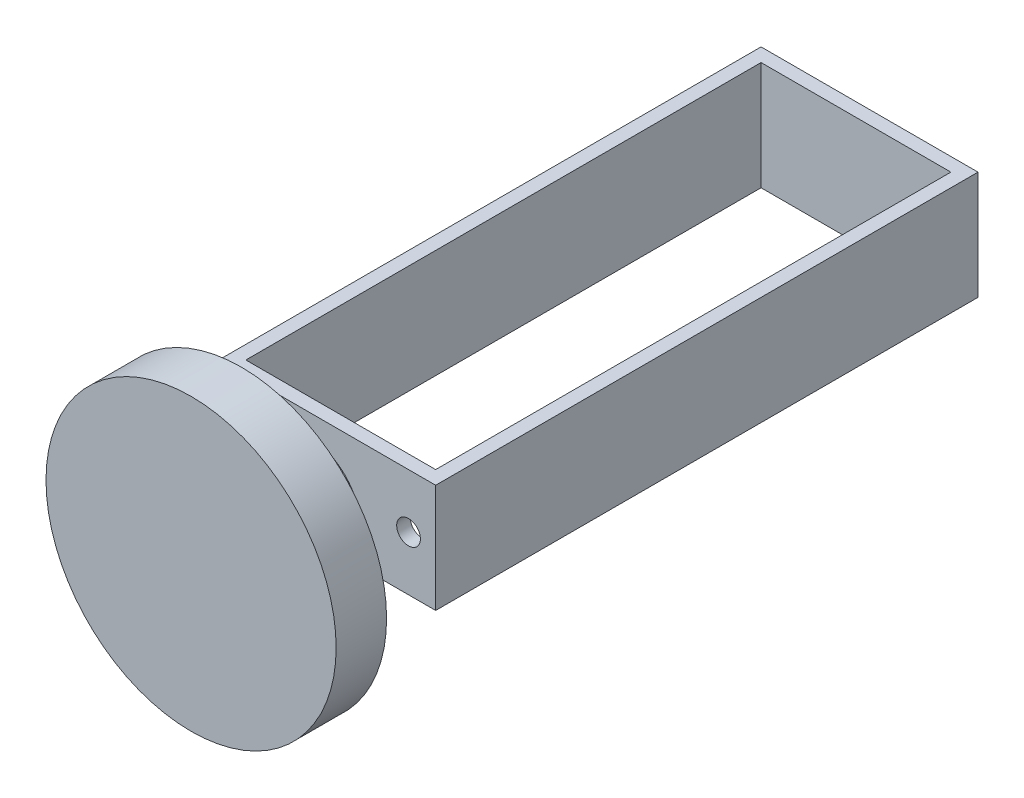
ISO-10303-21;
HEADER;
FILE_DESCRIPTION(('STEP AP214'),'2;1');
FILE_NAME('part.step','',(''),(''),'','','');
FILE_SCHEMA(('AUTOMOTIVE_DESIGN { 1 0 10303 214 1 1 1 1 }'));
ENDSEC;
DATA;
#1=APPLICATION_CONTEXT('core data for automotive mechanical design processes');
#2=APPLICATION_PROTOCOL_DEFINITION('international standard','automotive_design',2000,#1);
#3=PRODUCT_CONTEXT('',#1,'mechanical');
#4=PRODUCT('Part','Part','',(#3));
#5=PRODUCT_RELATED_PRODUCT_CATEGORY('part','',(#4));
#6=PRODUCT_DEFINITION_FORMATION('','',#4);
#7=PRODUCT_DEFINITION_CONTEXT('part definition',#1,'design');
#8=PRODUCT_DEFINITION('design','',#6,#7);
#9=PRODUCT_DEFINITION_SHAPE('','',#8);
#10=(LENGTH_UNIT() NAMED_UNIT(*) SI_UNIT(.MILLI.,.METRE.));
#11=(NAMED_UNIT(*) PLANE_ANGLE_UNIT() SI_UNIT($,.RADIAN.));
#12=(NAMED_UNIT(*) SI_UNIT($,.STERADIAN.) SOLID_ANGLE_UNIT());
#13=UNCERTAINTY_MEASURE_WITH_UNIT(LENGTH_MEASURE(1.E-05),#10,'distance_accuracy_value','');
#14=(GEOMETRIC_REPRESENTATION_CONTEXT(3) GLOBAL_UNCERTAINTY_ASSIGNED_CONTEXT((#13)) GLOBAL_UNIT_ASSIGNED_CONTEXT((#10,
#11,#12)) REPRESENTATION_CONTEXT('',''));
#15=CARTESIAN_POINT('',(0.,0.,0.));
#16=DIRECTION('',(0.,0.,1.));
#17=DIRECTION('',(1.,0.,0.));
#18=AXIS2_PLACEMENT_3D('',#15,#16,#17);
#19=CARTESIAN_POINT('',(0.,25.4,0.));
#20=DIRECTION('',(0.,-1.,0.));
#21=DIRECTION('',(0.,0.,-1.));
#22=AXIS2_PLACEMENT_3D('',#19,#20,#21);
#23=PLANE('',#22);
#24=DIRECTION('',(0.,0.,-1.));
#25=VECTOR('',#24,1.);
#26=CARTESIAN_POINT('',(25.4,25.4,63.5));
#27=LINE('',#26,#25);
#28=CARTESIAN_POINT('',(25.4,25.4,63.5));
#29=VERTEX_POINT('',#28);
#30=CARTESIAN_POINT('',(25.4,25.4,-63.5));
#31=VERTEX_POINT('',#30);
#32=EDGE_CURVE('E143',#29,#31,#27,.T.);
#33=ORIENTED_EDGE('',*,*,#32,.T.);
#34=DIRECTION('',(-1.,0.,0.));
#35=VECTOR('',#34,1.);
#36=CARTESIAN_POINT('',(-25.4,25.4,-63.5));
#37=LINE('',#36,#35);
#38=CARTESIAN_POINT('',(-25.4,25.4,-63.5));
#39=VERTEX_POINT('',#38);
#40=EDGE_CURVE('E146',#31,#39,#37,.T.);
#41=ORIENTED_EDGE('',*,*,#40,.T.);
#42=DIRECTION('',(0.,0.,1.));
#43=VECTOR('',#42,1.);
#44=CARTESIAN_POINT('',(-25.4,25.4,63.5));
#45=LINE('',#44,#43);
#46=CARTESIAN_POINT('',(-25.4,25.4,63.5));
#47=VERTEX_POINT('',#46);
#48=EDGE_CURVE('E149',#39,#47,#45,.T.);
#49=ORIENTED_EDGE('',*,*,#48,.T.);
#50=DIRECTION('',(1.,0.,0.));
#51=VECTOR('',#50,1.);
#52=CARTESIAN_POINT('',(-25.4,25.4,63.5));
#53=LINE('',#52,#51);
#54=EDGE_CURVE('E151',#47,#29,#53,.T.);
#55=ORIENTED_EDGE('',*,*,#54,.T.);
#56=EDGE_LOOP('',(#33,#41,#49,#55));
#57=FACE_BOUND('',#56,.T.);
#58=DIRECTION('',(0.,0.,1.));
#59=VECTOR('',#58,1.);
#60=CARTESIAN_POINT('',(-22.225,25.4,60.325));
#61=LINE('',#60,#59);
#62=CARTESIAN_POINT('',(-22.225,25.4,-60.325));
#63=VERTEX_POINT('',#62);
#64=CARTESIAN_POINT('',(-22.225,25.4,60.325));
#65=VERTEX_POINT('',#64);
#66=EDGE_CURVE('E105',#63,#65,#61,.T.);
#67=ORIENTED_EDGE('',*,*,#66,.F.);
#68=DIRECTION('',(-1.,0.,0.));
#69=VECTOR('',#68,1.);
#70=CARTESIAN_POINT('',(-22.225,25.4,-60.325));
#71=LINE('',#70,#69);
#72=CARTESIAN_POINT('',(22.225,25.4,-60.325));
#73=VERTEX_POINT('',#72);
#74=EDGE_CURVE('E127',#73,#63,#71,.T.);
#75=ORIENTED_EDGE('',*,*,#74,.F.);
#76=DIRECTION('',(0.,0.,-1.));
#77=VECTOR('',#76,1.);
#78=CARTESIAN_POINT('',(22.225,25.4,60.325));
#79=LINE('',#78,#77);
#80=CARTESIAN_POINT('',(22.225,25.4,60.325));
#81=VERTEX_POINT('',#80);
#82=EDGE_CURVE('E125',#81,#73,#79,.T.);
#83=ORIENTED_EDGE('',*,*,#82,.F.);
#84=DIRECTION('',(1.,0.,0.));
#85=VECTOR('',#84,1.);
#86=CARTESIAN_POINT('',(-22.225,25.4,60.325));
#87=LINE('',#86,#85);
#88=EDGE_CURVE('E113',#65,#81,#87,.T.);
#89=ORIENTED_EDGE('',*,*,#88,.F.);
#90=EDGE_LOOP('',(#67,#75,#83,#89));
#91=FACE_BOUND('',#90,.T.);
#92=ADVANCED_FACE('F40',(#57,#91),#23,.F.);
#93=CARTESIAN_POINT('',(0.,0.,0.));
#94=DIRECTION('',(0.,-1.,0.));
#95=DIRECTION('',(0.,0.,-1.));
#96=AXIS2_PLACEMENT_3D('',#93,#94,#95);
#97=PLANE('',#96);
#98=DIRECTION('',(0.,0.,-1.));
#99=VECTOR('',#98,1.);
#100=CARTESIAN_POINT('',(25.4,0.,63.5));
#101=LINE('',#100,#99);
#102=CARTESIAN_POINT('',(25.4,0.,63.5));
#103=VERTEX_POINT('',#102);
#104=CARTESIAN_POINT('',(25.4,0.,-63.5));
#105=VERTEX_POINT('',#104);
#106=EDGE_CURVE('E121',#103,#105,#101,.T.);
#107=ORIENTED_EDGE('',*,*,#106,.F.);
#108=DIRECTION('',(1.,0.,0.));
#109=VECTOR('',#108,1.);
#110=CARTESIAN_POINT('',(-25.4,0.,63.5));
#111=LINE('',#110,#109);
#112=CARTESIAN_POINT('',(-25.4,0.,63.5));
#113=VERTEX_POINT('',#112);
#114=EDGE_CURVE('E147',#113,#103,#111,.T.);
#115=ORIENTED_EDGE('',*,*,#114,.F.);
#116=DIRECTION('',(0.,0.,1.));
#117=VECTOR('',#116,1.);
#118=CARTESIAN_POINT('',(-25.4,0.,63.5));
#119=LINE('',#118,#117);
#120=CARTESIAN_POINT('',(-25.4,0.,-63.5));
#121=VERTEX_POINT('',#120);
#122=EDGE_CURVE('E158',#121,#113,#119,.T.);
#123=ORIENTED_EDGE('',*,*,#122,.F.);
#124=DIRECTION('',(-1.,0.,0.));
#125=VECTOR('',#124,1.);
#126=CARTESIAN_POINT('',(-25.4,0.,-63.5));
#127=LINE('',#126,#125);
#128=EDGE_CURVE('E156',#105,#121,#127,.T.);
#129=ORIENTED_EDGE('',*,*,#128,.F.);
#130=EDGE_LOOP('',(#107,#115,#123,#129));
#131=FACE_BOUND('',#130,.T.);
#132=DIRECTION('',(-1.,0.,0.));
#133=VECTOR('',#132,1.);
#134=CARTESIAN_POINT('',(-22.225,0.,-60.325));
#135=LINE('',#134,#133);
#136=CARTESIAN_POINT('',(22.225,0.,-60.325));
#137=VERTEX_POINT('',#136);
#138=CARTESIAN_POINT('',(-22.225,0.,-60.325));
#139=VERTEX_POINT('',#138);
#140=EDGE_CURVE('E114',#137,#139,#135,.T.);
#141=ORIENTED_EDGE('',*,*,#140,.T.);
#142=DIRECTION('',(0.,0.,1.));
#143=VECTOR('',#142,1.);
#144=CARTESIAN_POINT('',(-22.225,0.,60.325));
#145=LINE('',#144,#143);
#146=CARTESIAN_POINT('',(-22.225,0.,60.325));
#147=VERTEX_POINT('',#146);
#148=EDGE_CURVE('E63',#139,#147,#145,.T.);
#149=ORIENTED_EDGE('',*,*,#148,.T.);
#150=DIRECTION('',(1.,0.,0.));
#151=VECTOR('',#150,1.);
#152=CARTESIAN_POINT('',(-22.225,0.,60.325));
#153=LINE('',#152,#151);
#154=CARTESIAN_POINT('',(22.225,0.,60.325));
#155=VERTEX_POINT('',#154);
#156=EDGE_CURVE('E120',#147,#155,#153,.T.);
#157=ORIENTED_EDGE('',*,*,#156,.T.);
#158=DIRECTION('',(0.,0.,-1.));
#159=VECTOR('',#158,1.);
#160=CARTESIAN_POINT('',(22.225,0.,60.325));
#161=LINE('',#160,#159);
#162=EDGE_CURVE('E135',#155,#137,#161,.T.);
#163=ORIENTED_EDGE('',*,*,#162,.T.);
#164=EDGE_LOOP('',(#141,#149,#157,#163));
#165=FACE_BOUND('',#164,.T.);
#166=ADVANCED_FACE('F232',(#131,#165),#97,.T.);
#167=CARTESIAN_POINT('',(25.4,25.4,63.5));
#168=DIRECTION('',(-1.,0.,0.));
#169=DIRECTION('',(0.,0.,1.));
#170=AXIS2_PLACEMENT_3D('',#167,#168,#169);
#171=PLANE('',#170);
#172=ORIENTED_EDGE('',*,*,#106,.T.);
#173=DIRECTION('',(0.,-1.,0.));
#174=VECTOR('',#173,1.);
#175=CARTESIAN_POINT('',(25.4,25.4,-63.5));
#176=LINE('',#175,#174);
#177=EDGE_CURVE('E48',#31,#105,#176,.T.);
#178=ORIENTED_EDGE('',*,*,#177,.F.);
#179=ORIENTED_EDGE('',*,*,#32,.F.);
#180=DIRECTION('',(0.,-1.,0.));
#181=VECTOR('',#180,1.);
#182=CARTESIAN_POINT('',(25.4,25.4,63.5));
#183=LINE('',#182,#181);
#184=EDGE_CURVE('E153',#29,#103,#183,.T.);
#185=ORIENTED_EDGE('',*,*,#184,.T.);
#186=EDGE_LOOP('',(#172,#178,#179,#185));
#187=FACE_BOUND('',#186,.T.);
#188=ADVANCED_FACE('F42',(#187),#171,.F.);
#189=CARTESIAN_POINT('',(-25.4,25.4,-63.5));
#190=DIRECTION('',(0.,0.,1.));
#191=DIRECTION('',(1.,0.,0.));
#192=AXIS2_PLACEMENT_3D('',#189,#190,#191);
#193=PLANE('',#192);
#194=ORIENTED_EDGE('',*,*,#128,.T.);
#195=DIRECTION('',(0.,-1.,0.));
#196=VECTOR('',#195,1.);
#197=CARTESIAN_POINT('',(-25.4,25.4,-63.5));
#198=LINE('',#197,#196);
#199=EDGE_CURVE('E166',#39,#121,#198,.T.);
#200=ORIENTED_EDGE('',*,*,#199,.F.);
#201=ORIENTED_EDGE('',*,*,#40,.F.);
#202=ORIENTED_EDGE('',*,*,#177,.T.);
#203=EDGE_LOOP('',(#194,#200,#201,#202));
#204=FACE_BOUND('',#203,.T.);
#205=ADVANCED_FACE('F248',(#204),#193,.F.);
#206=CARTESIAN_POINT('',(-25.4,25.4,63.5));
#207=DIRECTION('',(1.,0.,0.));
#208=DIRECTION('',(0.,0.,-1.));
#209=AXIS2_PLACEMENT_3D('',#206,#207,#208);
#210=PLANE('',#209);
#211=ORIENTED_EDGE('',*,*,#122,.T.);
#212=DIRECTION('',(0.,-1.,0.));
#213=VECTOR('',#212,1.);
#214=CARTESIAN_POINT('',(-25.4,25.4,63.5));
#215=LINE('',#214,#213);
#216=EDGE_CURVE('E163',#47,#113,#215,.T.);
#217=ORIENTED_EDGE('',*,*,#216,.F.);
#218=ORIENTED_EDGE('',*,*,#48,.F.);
#219=ORIENTED_EDGE('',*,*,#199,.T.);
#220=EDGE_LOOP('',(#211,#217,#218,#219));
#221=FACE_BOUND('',#220,.T.);
#222=ADVANCED_FACE('F245',(#221),#210,.F.);
#223=CARTESIAN_POINT('',(-25.4,25.4,63.5));
#224=DIRECTION('',(0.,0.,-1.));
#225=DIRECTION('',(-1.,0.,0.));
#226=AXIS2_PLACEMENT_3D('',#223,#224,#225);
#227=PLANE('',#226);
#228=CARTESIAN_POINT('',(0.,12.7,63.5));
#229=DIRECTION('',(0.,0.,-1.));
#230=DIRECTION('',(-1.,0.,0.));
#231=AXIS2_PLACEMENT_3D('',#228,#229,#230);
#232=CIRCLE('',#231,5.588);
#233=CARTESIAN_POINT('',(-5.588,12.7,63.5));
#234=VERTEX_POINT('',#233);
#235=EDGE_CURVE('E11',#234,#234,#232,.F.);
#236=ORIENTED_EDGE('',*,*,#235,.F.);
#237=EDGE_LOOP('',(#236));
#238=FACE_BOUND('',#237,.T.);
#239=CARTESIAN_POINT('',(-19.05,12.7,63.5));
#240=DIRECTION('',(0.,0.,1.));
#241=DIRECTION('',(1.,0.,0.));
#242=AXIS2_PLACEMENT_3D('',#239,#240,#241);
#243=CIRCLE('',#242,2.778125);
#244=CARTESIAN_POINT('',(-16.271875,12.7,63.5));
#245=VERTEX_POINT('',#244);
#246=EDGE_CURVE('E173',#245,#245,#243,.T.);
#247=ORIENTED_EDGE('',*,*,#246,.F.);
#248=EDGE_LOOP('',(#247));
#249=FACE_BOUND('',#248,.T.);
#250=CARTESIAN_POINT('',(19.05,12.7,63.5));
#251=DIRECTION('',(0.,0.,1.));
#252=DIRECTION('',(1.,0.,0.));
#253=AXIS2_PLACEMENT_3D('',#250,#251,#252);
#254=CIRCLE('',#253,2.778125);
#255=CARTESIAN_POINT('',(21.828125,12.7,63.5));
#256=VERTEX_POINT('',#255);
#257=EDGE_CURVE('E193',#256,#256,#254,.T.);
#258=ORIENTED_EDGE('',*,*,#257,.F.);
#259=EDGE_LOOP('',(#258));
#260=FACE_BOUND('',#259,.T.);
#261=ORIENTED_EDGE('',*,*,#114,.T.);
#262=ORIENTED_EDGE('',*,*,#184,.F.);
#263=ORIENTED_EDGE('',*,*,#54,.F.);
#264=ORIENTED_EDGE('',*,*,#216,.T.);
#265=EDGE_LOOP('',(#261,#262,#263,#264));
#266=FACE_BOUND('',#265,.T.);
#267=ADVANCED_FACE('F242',(#238,#249,#260,#266),#227,.F.);
#268=CARTESIAN_POINT('',(-22.225,25.4,60.325));
#269=DIRECTION('',(1.,0.,0.));
#270=DIRECTION('',(0.,0.,-1.));
#271=AXIS2_PLACEMENT_3D('',#268,#269,#270);
#272=PLANE('',#271);
#273=ORIENTED_EDGE('',*,*,#148,.F.);
#274=DIRECTION('',(0.,-1.,0.));
#275=VECTOR('',#274,1.);
#276=CARTESIAN_POINT('',(-22.225,25.4,-60.325));
#277=LINE('',#276,#275);
#278=EDGE_CURVE('E109',#63,#139,#277,.T.);
#279=ORIENTED_EDGE('',*,*,#278,.F.);
#280=ORIENTED_EDGE('',*,*,#66,.T.);
#281=DIRECTION('',(0.,-1.,0.));
#282=VECTOR('',#281,1.);
#283=CARTESIAN_POINT('',(-22.225,25.4,60.325));
#284=LINE('',#283,#282);
#285=EDGE_CURVE('E108',#65,#147,#284,.T.);
#286=ORIENTED_EDGE('',*,*,#285,.T.);
#287=EDGE_LOOP('',(#273,#279,#280,#286));
#288=FACE_BOUND('',#287,.T.);
#289=ADVANCED_FACE('F107',(#288),#272,.T.);
#290=CARTESIAN_POINT('',(-22.225,25.4,60.325));
#291=DIRECTION('',(0.,0.,-1.));
#292=DIRECTION('',(-1.,0.,0.));
#293=AXIS2_PLACEMENT_3D('',#290,#291,#292);
#294=PLANE('',#293);
#295=CARTESIAN_POINT('',(-19.05,12.7,60.325));
#296=DIRECTION('',(0.,0.,-1.));
#297=DIRECTION('',(-1.,0.,0.));
#298=AXIS2_PLACEMENT_3D('',#295,#296,#297);
#299=CIRCLE('',#298,2.778125);
#300=CARTESIAN_POINT('',(-21.828125,12.7,60.325));
#301=VERTEX_POINT('',#300);
#302=EDGE_CURVE('E133',#301,#301,#299,.T.);
#303=ORIENTED_EDGE('',*,*,#302,.F.);
#304=EDGE_LOOP('',(#303));
#305=FACE_BOUND('',#304,.T.);
#306=CARTESIAN_POINT('',(19.05,12.7,60.325));
#307=DIRECTION('',(0.,0.,-1.));
#308=DIRECTION('',(-1.,0.,0.));
#309=AXIS2_PLACEMENT_3D('',#306,#307,#308);
#310=CIRCLE('',#309,2.778125);
#311=CARTESIAN_POINT('',(16.271875,12.7,60.325));
#312=VERTEX_POINT('',#311);
#313=EDGE_CURVE('E171',#312,#312,#310,.T.);
#314=ORIENTED_EDGE('',*,*,#313,.F.);
#315=EDGE_LOOP('',(#314));
#316=FACE_BOUND('',#315,.T.);
#317=ORIENTED_EDGE('',*,*,#156,.F.);
#318=ORIENTED_EDGE('',*,*,#285,.F.);
#319=ORIENTED_EDGE('',*,*,#88,.T.);
#320=DIRECTION('',(0.,-1.,0.));
#321=VECTOR('',#320,1.);
#322=CARTESIAN_POINT('',(22.225,25.4,60.325));
#323=LINE('',#322,#321);
#324=EDGE_CURVE('E122',#81,#155,#323,.T.);
#325=ORIENTED_EDGE('',*,*,#324,.T.);
#326=EDGE_LOOP('',(#317,#318,#319,#325));
#327=FACE_BOUND('',#326,.T.);
#328=ADVANCED_FACE('F117',(#305,#316,#327),#294,.T.);
#329=CARTESIAN_POINT('',(22.225,25.4,60.325));
#330=DIRECTION('',(-1.,0.,0.));
#331=DIRECTION('',(0.,0.,1.));
#332=AXIS2_PLACEMENT_3D('',#329,#330,#331);
#333=PLANE('',#332);
#334=ORIENTED_EDGE('',*,*,#162,.F.);
#335=ORIENTED_EDGE('',*,*,#324,.F.);
#336=ORIENTED_EDGE('',*,*,#82,.T.);
#337=DIRECTION('',(0.,-1.,0.));
#338=VECTOR('',#337,1.);
#339=CARTESIAN_POINT('',(22.225,25.4,-60.325));
#340=LINE('',#339,#338);
#341=EDGE_CURVE('E55',#73,#137,#340,.T.);
#342=ORIENTED_EDGE('',*,*,#341,.T.);
#343=EDGE_LOOP('',(#334,#335,#336,#342));
#344=FACE_BOUND('',#343,.T.);
#345=ADVANCED_FACE('F182',(#344),#333,.T.);
#346=CARTESIAN_POINT('',(-22.225,25.4,-60.325));
#347=DIRECTION('',(0.,0.,1.));
#348=DIRECTION('',(1.,0.,0.));
#349=AXIS2_PLACEMENT_3D('',#346,#347,#348);
#350=PLANE('',#349);
#351=ORIENTED_EDGE('',*,*,#140,.F.);
#352=ORIENTED_EDGE('',*,*,#341,.F.);
#353=ORIENTED_EDGE('',*,*,#74,.T.);
#354=ORIENTED_EDGE('',*,*,#278,.T.);
#355=EDGE_LOOP('',(#351,#352,#353,#354));
#356=FACE_BOUND('',#355,.T.);
#357=ADVANCED_FACE('F189',(#356),#350,.T.);
#358=CARTESIAN_POINT('',(19.05,12.7,38.1));
#359=DIRECTION('',(0.,0.,1.));
#360=DIRECTION('',(1.,0.,0.));
#361=AXIS2_PLACEMENT_3D('',#358,#359,#360);
#362=CYLINDRICAL_SURFACE('',#361,2.778125);
#363=ORIENTED_EDGE('',*,*,#313,.T.);
#364=EDGE_LOOP('',(#363));
#365=FACE_BOUND('',#364,.T.);
#366=ORIENTED_EDGE('',*,*,#257,.T.);
#367=EDGE_LOOP('',(#366));
#368=FACE_BOUND('',#367,.T.);
#369=ADVANCED_FACE('F186',(#365,#368),#362,.F.);
#370=CARTESIAN_POINT('',(-19.05,12.7,38.1));
#371=DIRECTION('',(0.,0.,1.));
#372=DIRECTION('',(1.,0.,0.));
#373=AXIS2_PLACEMENT_3D('',#370,#371,#372);
#374=CYLINDRICAL_SURFACE('',#373,2.778125);
#375=ORIENTED_EDGE('',*,*,#302,.T.);
#376=EDGE_LOOP('',(#375));
#377=FACE_BOUND('',#376,.T.);
#378=ORIENTED_EDGE('',*,*,#246,.T.);
#379=EDGE_LOOP('',(#378));
#380=FACE_BOUND('',#379,.T.);
#381=ADVANCED_FACE('F177',(#377,#380),#374,.F.);
#382=CARTESIAN_POINT('',(0.,12.7,68.326));
#383=DIRECTION('',(0.,0.,-1.));
#384=DIRECTION('',(-1.,0.,0.));
#385=AXIS2_PLACEMENT_3D('',#382,#383,#384);
#386=CYLINDRICAL_SURFACE('',#385,5.588);
#387=CARTESIAN_POINT('',(0.,12.7,68.326));
#388=DIRECTION('',(0.,0.,1.));
#389=DIRECTION('',(1.,0.,0.));
#390=AXIS2_PLACEMENT_3D('',#387,#388,#389);
#391=CIRCLE('',#390,5.588);
#392=CARTESIAN_POINT('',(5.588,12.7,68.326));
#393=VERTEX_POINT('',#392);
#394=EDGE_CURVE('E195',#393,#393,#391,.T.);
#395=ORIENTED_EDGE('',*,*,#394,.F.);
#396=EDGE_LOOP('',(#395));
#397=FACE_BOUND('',#396,.T.);
#398=ORIENTED_EDGE('',*,*,#235,.T.);
#399=EDGE_LOOP('',(#398));
#400=FACE_BOUND('',#399,.T.);
#401=ADVANCED_FACE('F279',(#397,#400),#386,.T.);
#402=CARTESIAN_POINT('',(0.,12.7,83.566));
#403=DIRECTION('',(0.,0.,-1.));
#404=DIRECTION('',(-1.,0.,0.));
#405=AXIS2_PLACEMENT_3D('',#402,#403,#404);
#406=CYLINDRICAL_SURFACE('',#405,12.7);
#407=CARTESIAN_POINT('',(0.,12.7,83.566));
#408=DIRECTION('',(0.,0.,1.));
#409=DIRECTION('',(1.,0.,0.));
#410=AXIS2_PLACEMENT_3D('',#407,#408,#409);
#411=CIRCLE('',#410,12.7);
#412=CARTESIAN_POINT('',(-12.7,12.7,83.566));
#413=VERTEX_POINT('',#412);
#414=EDGE_CURVE('E199',#413,#413,#411,.T.);
#415=CARTESIAN_POINT('',(0.,12.7,68.326));
#416=DIRECTION('',(0.,0.,1.));
#417=DIRECTION('',(1.,0.,0.));
#418=AXIS2_PLACEMENT_3D('',#415,#416,#417);
#419=CIRCLE('',#418,12.7);
#420=CARTESIAN_POINT('',(-12.7,12.7,68.326));
#421=VERTEX_POINT('',#420);
#422=EDGE_CURVE('E202',#421,#421,#419,.T.);
#423=CARTESIAN_POINT('',(-12.7,12.7,83.566));
#424=CARTESIAN_POINT('',(-12.7,12.7,83.40725));
#425=CARTESIAN_POINT('',(-12.7,12.7,83.2485));
#426=CARTESIAN_POINT('',(-12.7,12.7,82.931));
#427=CARTESIAN_POINT('',(-12.7,12.7,82.77225));
#428=CARTESIAN_POINT('',(-12.7,12.7,82.45475));
#429=CARTESIAN_POINT('',(-12.7,12.7,82.296));
#430=CARTESIAN_POINT('',(-12.7,12.7,81.9785));
#431=CARTESIAN_POINT('',(-12.7,12.7,81.81975));
#432=CARTESIAN_POINT('',(-12.7,12.7,81.50225));
#433=CARTESIAN_POINT('',(-12.7,12.7,81.3435));
#434=CARTESIAN_POINT('',(-12.7,12.7,81.026));
#435=CARTESIAN_POINT('',(-12.7,12.7,80.86725));
#436=CARTESIAN_POINT('',(-12.7,12.7,80.54975));
#437=CARTESIAN_POINT('',(-12.7,12.7,80.391));
#438=CARTESIAN_POINT('',(-12.7,12.7,80.0735));
#439=CARTESIAN_POINT('',(-12.7,12.7,79.91475));
#440=CARTESIAN_POINT('',(-12.7,12.7,79.59725));
#441=CARTESIAN_POINT('',(-12.7,12.7,79.4385));
#442=CARTESIAN_POINT('',(-12.7,12.7,79.121));
#443=CARTESIAN_POINT('',(-12.7,12.7,78.96225));
#444=CARTESIAN_POINT('',(-12.7,12.7,78.64475));
#445=CARTESIAN_POINT('',(-12.7,12.7,78.486));
#446=CARTESIAN_POINT('',(-12.7,12.7,78.1685));
#447=CARTESIAN_POINT('',(-12.7,12.7,78.00975));
#448=CARTESIAN_POINT('',(-12.7,12.7,77.69225));
#449=CARTESIAN_POINT('',(-12.7,12.7,77.5335));
#450=CARTESIAN_POINT('',(-12.7,12.7,77.216));
#451=CARTESIAN_POINT('',(-12.7,12.7,77.05725));
#452=CARTESIAN_POINT('',(-12.7,12.7,76.73975));
#453=CARTESIAN_POINT('',(-12.7,12.7,76.581));
#454=CARTESIAN_POINT('',(-12.7,12.7,76.2635));
#455=CARTESIAN_POINT('',(-12.7,12.7,76.10475));
#456=CARTESIAN_POINT('',(-12.7,12.7,75.78725));
#457=CARTESIAN_POINT('',(-12.7,12.7,75.6285));
#458=CARTESIAN_POINT('',(-12.7,12.7,75.311));
#459=CARTESIAN_POINT('',(-12.7,12.7,75.15225));
#460=CARTESIAN_POINT('',(-12.7,12.7,74.83475));
#461=CARTESIAN_POINT('',(-12.7,12.7,74.676));
#462=CARTESIAN_POINT('',(-12.7,12.7,74.3585));
#463=CARTESIAN_POINT('',(-12.7,12.7,74.19975));
#464=CARTESIAN_POINT('',(-12.7,12.7,73.88225));
#465=CARTESIAN_POINT('',(-12.7,12.7,73.7235));
#466=CARTESIAN_POINT('',(-12.7,12.7,73.406));
#467=CARTESIAN_POINT('',(-12.7,12.7,73.24725));
#468=CARTESIAN_POINT('',(-12.7,12.7,72.92975));
#469=CARTESIAN_POINT('',(-12.7,12.7,72.771));
#470=CARTESIAN_POINT('',(-12.7,12.7,72.4535));
#471=CARTESIAN_POINT('',(-12.7,12.7,72.29475));
#472=CARTESIAN_POINT('',(-12.7,12.7,71.97725));
#473=CARTESIAN_POINT('',(-12.7,12.7,71.8185));
#474=CARTESIAN_POINT('',(-12.7,12.7,71.501));
#475=CARTESIAN_POINT('',(-12.7,12.7,71.34225));
#476=CARTESIAN_POINT('',(-12.7,12.7,71.02475));
#477=CARTESIAN_POINT('',(-12.7,12.7,70.866));
#478=CARTESIAN_POINT('',(-12.7,12.7,70.5485));
#479=CARTESIAN_POINT('',(-12.7,12.7,70.38975));
#480=CARTESIAN_POINT('',(-12.7,12.7,70.07225));
#481=CARTESIAN_POINT('',(-12.7,12.7,69.9135));
#482=CARTESIAN_POINT('',(-12.7,12.7,69.596));
#483=CARTESIAN_POINT('',(-12.7,12.7,69.43725));
#484=CARTESIAN_POINT('',(-12.7,12.7,69.11975));
#485=CARTESIAN_POINT('',(-12.7,12.7,68.961));
#486=CARTESIAN_POINT('',(-12.7,12.7,68.6435));
#487=CARTESIAN_POINT('',(-12.7,12.7,68.48475));
#488=CARTESIAN_POINT('',(-12.7,12.7,68.326));
#489=B_SPLINE_CURVE_WITH_KNOTS('',3,(#423,#424,#425,#426,#427,#428,#429,#430,#431,#432,#433,
#434,#435,#436,#437,#438,#439,#440,#441,#442,#443,#444,#445,#446,#447,#448,#449,#450,#451,#452,
#453,#454,#455,#456,#457,#458,#459,#460,#461,#462,#463,#464,#465,#466,#467,#468,#469,#470,#471,
#472,#473,#474,#475,#476,#477,#478,#479,#480,#481,#482,#483,#484,#485,#486,#487,#488),
.UNSPECIFIED.,.F.,.F.,(4,2,2,2,2,2,2,2,2,2,2,2,2,2,2,2,2,2,2,2,2,2,2,2,2,2,2,2,2,2,2,2,4),(0.,
0.476250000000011,0.952500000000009,1.42875000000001,1.905,2.38125,2.85750000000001,
3.33375000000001,3.81000000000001,4.28625000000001,4.7625,5.23875000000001,5.71500000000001,
6.19125000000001,6.66750000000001,7.14375,7.62000000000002,8.09625000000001,8.57250000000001,
9.04875000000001,9.52500000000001,10.00125,10.4775,10.95375,11.43,11.90625,12.3825,12.85875,
13.335,13.81125,14.2875,14.76375,15.24),.UNSPECIFIED.);
#490=EDGE_CURVE('BSEAM282',#413,#421,#489,.T.);
#491=ORIENTED_EDGE('',*,*,#414,.F.);
#492=ORIENTED_EDGE('',*,*,#422,.T.);
#493=ORIENTED_EDGE('',*,*,#490,.T.);
#494=ORIENTED_EDGE('',*,*,#490,.F.);
#495=EDGE_LOOP('',(#491,#493,#492,#494));
#496=FACE_BOUND('',#495,.T.);
#497=ADVANCED_FACE('F282',(#496),#406,.T.);
#498=CARTESIAN_POINT('',(0.,0.,68.326));
#499=DIRECTION('',(0.,0.,1.));
#500=DIRECTION('',(1.,0.,0.));
#501=AXIS2_PLACEMENT_3D('',#498,#499,#500);
#502=PLANE('',#501);
#503=ORIENTED_EDGE('',*,*,#394,.T.);
#504=EDGE_LOOP('',(#503));
#505=FACE_BOUND('',#504,.T.);
#506=ORIENTED_EDGE('',*,*,#422,.F.);
#507=EDGE_LOOP('',(#506));
#508=FACE_BOUND('',#507,.T.);
#509=ADVANCED_FACE('F219',(#505,#508),#502,.F.);
#510=CARTESIAN_POINT('',(0.,12.7,95.377));
#511=DIRECTION('',(0.,0.,-1.));
#512=DIRECTION('',(-1.,0.,0.));
#513=AXIS2_PLACEMENT_3D('',#510,#511,#512);
#514=CYLINDRICAL_SURFACE('',#513,33.9725);
#515=CARTESIAN_POINT('',(0.,12.7,95.377));
#516=DIRECTION('',(0.,0.,1.));
#517=DIRECTION('',(1.,0.,0.));
#518=AXIS2_PLACEMENT_3D('',#515,#516,#517);
#519=CIRCLE('',#518,33.9725);
#520=CARTESIAN_POINT('',(33.9725,12.7,95.377));
#521=VERTEX_POINT('',#520);
#522=EDGE_CURVE('E205',#521,#521,#519,.T.);
#523=ORIENTED_EDGE('',*,*,#522,.F.);
#524=EDGE_LOOP('',(#523));
#525=FACE_BOUND('',#524,.T.);
#526=CARTESIAN_POINT('',(0.,12.7,83.566));
#527=DIRECTION('',(0.,0.,1.));
#528=DIRECTION('',(1.,0.,0.));
#529=AXIS2_PLACEMENT_3D('',#526,#527,#528);
#530=CIRCLE('',#529,33.9725);
#531=CARTESIAN_POINT('',(33.9725,12.7,83.566));
#532=VERTEX_POINT('',#531);
#533=EDGE_CURVE('E208',#532,#532,#530,.T.);
#534=ORIENTED_EDGE('',*,*,#533,.T.);
#535=EDGE_LOOP('',(#534));
#536=FACE_BOUND('',#535,.T.);
#537=ADVANCED_FACE('F216',(#525,#536),#514,.T.);
#538=CARTESIAN_POINT('',(0.,0.,95.377));
#539=DIRECTION('',(0.,0.,1.));
#540=DIRECTION('',(1.,0.,0.));
#541=AXIS2_PLACEMENT_3D('',#538,#539,#540);
#542=PLANE('',#541);
#543=ORIENTED_EDGE('',*,*,#522,.T.);
#544=EDGE_LOOP('',(#543));
#545=FACE_BOUND('',#544,.T.);
#546=ADVANCED_FACE('F214',(#545),#542,.T.);
#547=CARTESIAN_POINT('',(0.,0.,83.566));
#548=DIRECTION('',(0.,0.,1.));
#549=DIRECTION('',(1.,0.,0.));
#550=AXIS2_PLACEMENT_3D('',#547,#548,#549);
#551=PLANE('',#550);
#552=ORIENTED_EDGE('',*,*,#414,.T.);
#553=EDGE_LOOP('',(#552));
#554=FACE_BOUND('',#553,.T.);
#555=ORIENTED_EDGE('',*,*,#533,.F.);
#556=EDGE_LOOP('',(#555));
#557=FACE_BOUND('',#556,.T.);
#558=ADVANCED_FACE('F223',(#554,#557),#551,.F.);
#559=CLOSED_SHELL('',(#92,#166,#188,#205,#222,#267,#289,#328,#345,#357,#369,#381,#401,#497,#509,
#537,#546,#558));
#560=MANIFOLD_SOLID_BREP('B2',#559);
#561=ADVANCED_BREP_SHAPE_REPRESENTATION('',(#18,#560),#14);
#562=SHAPE_DEFINITION_REPRESENTATION(#9,#561);
ENDSEC;
END-ISO-10303-21;
